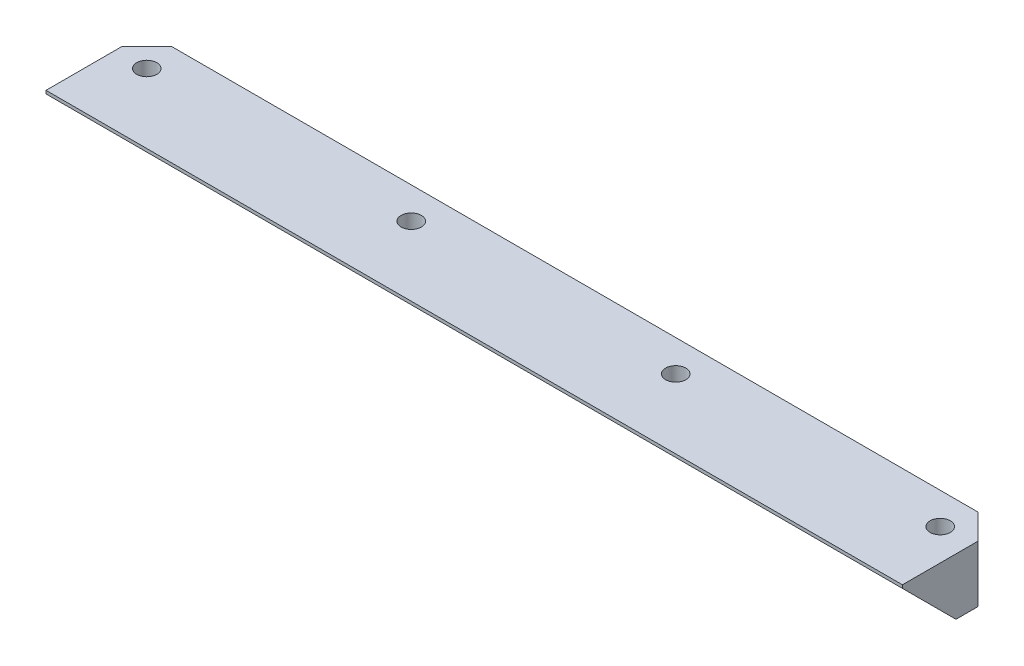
ISO-10303-21;
HEADER;
FILE_DESCRIPTION(('STEP AP214'),'2;1');
FILE_NAME('part.step','',(''),(''),'','','');
FILE_SCHEMA(('AUTOMOTIVE_DESIGN { 1 0 10303 214 1 1 1 1 }'));
ENDSEC;
DATA;
#1=APPLICATION_CONTEXT('core data for automotive mechanical design processes');
#2=APPLICATION_PROTOCOL_DEFINITION('international standard','automotive_design',2000,#1);
#3=PRODUCT_CONTEXT('',#1,'mechanical');
#4=PRODUCT('Part','Part','',(#3));
#5=PRODUCT_RELATED_PRODUCT_CATEGORY('part','',(#4));
#6=PRODUCT_DEFINITION_FORMATION('','',#4);
#7=PRODUCT_DEFINITION_CONTEXT('part definition',#1,'design');
#8=PRODUCT_DEFINITION('design','',#6,#7);
#9=PRODUCT_DEFINITION_SHAPE('','',#8);
#10=(LENGTH_UNIT() NAMED_UNIT(*) SI_UNIT(.MILLI.,.METRE.));
#11=(NAMED_UNIT(*) PLANE_ANGLE_UNIT() SI_UNIT($,.RADIAN.));
#12=(NAMED_UNIT(*) SI_UNIT($,.STERADIAN.) SOLID_ANGLE_UNIT());
#13=UNCERTAINTY_MEASURE_WITH_UNIT(LENGTH_MEASURE(1.E-05),#10,'distance_accuracy_value','');
#14=(GEOMETRIC_REPRESENTATION_CONTEXT(3) GLOBAL_UNCERTAINTY_ASSIGNED_CONTEXT((#13)) GLOBAL_UNIT_ASSIGNED_CONTEXT((#10,
#11,#12)) REPRESENTATION_CONTEXT('',''));
#15=CARTESIAN_POINT('',(0.,0.,0.));
#16=DIRECTION('',(0.,0.,1.));
#17=DIRECTION('',(1.,0.,0.));
#18=AXIS2_PLACEMENT_3D('',#15,#16,#17);
#19=CARTESIAN_POINT('',(107.95,14.2875,25.4));
#20=DIRECTION('',(0.,-1.,0.));
#21=DIRECTION('',(0.,0.,-1.));
#22=AXIS2_PLACEMENT_3D('',#19,#20,#21);
#23=PLANE('',#22);
#24=DIRECTION('',(-1.,0.,0.));
#25=VECTOR('',#24,1.);
#26=CARTESIAN_POINT('',(107.95,14.2875,0.));
#27=LINE('',#26,#25);
#28=CARTESIAN_POINT('',(101.6,14.2875,0.));
#29=VERTEX_POINT('',#28);
#30=CARTESIAN_POINT('',(-101.6,14.2875,0.));
#31=VERTEX_POINT('',#30);
#32=EDGE_CURVE('E114',#29,#31,#27,.T.);
#33=ORIENTED_EDGE('',*,*,#32,.T.);
#34=DIRECTION('',(-0.707106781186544,0.,0.707106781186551));
#35=VECTOR('',#34,1.);
#36=CARTESIAN_POINT('',(-101.6,14.2875,0.));
#37=LINE('',#36,#35);
#38=CARTESIAN_POINT('',(-107.95,14.2875,6.35000000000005));
#39=VERTEX_POINT('',#38);
#40=EDGE_CURVE('E149',#31,#39,#37,.T.);
#41=ORIENTED_EDGE('',*,*,#40,.T.);
#42=DIRECTION('',(0.,0.,1.));
#43=VECTOR('',#42,1.);
#44=CARTESIAN_POINT('',(-107.95,14.2875,25.4));
#45=LINE('',#44,#43);
#46=CARTESIAN_POINT('',(-107.95,14.2875,25.4));
#47=VERTEX_POINT('',#46);
#48=EDGE_CURVE('E111',#39,#47,#45,.T.);
#49=ORIENTED_EDGE('',*,*,#48,.T.);
#50=DIRECTION('',(-1.,0.,0.));
#51=VECTOR('',#50,1.);
#52=CARTESIAN_POINT('',(107.95,14.2875,25.4));
#53=LINE('',#52,#51);
#54=CARTESIAN_POINT('',(107.95,14.2875,25.4));
#55=VERTEX_POINT('',#54);
#56=EDGE_CURVE('E108',#55,#47,#53,.T.);
#57=ORIENTED_EDGE('',*,*,#56,.F.);
#58=DIRECTION('',(0.,0.,1.));
#59=VECTOR('',#58,1.);
#60=CARTESIAN_POINT('',(107.95,14.2875,25.4));
#61=LINE('',#60,#59);
#62=CARTESIAN_POINT('',(107.95,14.2875,6.35000000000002));
#63=VERTEX_POINT('',#62);
#64=EDGE_CURVE('E97',#63,#55,#61,.T.);
#65=ORIENTED_EDGE('',*,*,#64,.F.);
#66=DIRECTION('',(0.707106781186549,0.,0.707106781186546));
#67=VECTOR('',#66,1.);
#68=CARTESIAN_POINT('',(107.95,14.2875,6.35000000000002));
#69=LINE('',#68,#67);
#70=EDGE_CURVE('E147',#63,#29,#69,.F.);
#71=ORIENTED_EDGE('',*,*,#70,.T.);
#72=EDGE_LOOP('',(#33,#41,#49,#57,#65,#71));
#73=FACE_BOUND('',#72,.T.);
#74=CARTESIAN_POINT('',(100.0125,14.2875,7.93749999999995));
#75=DIRECTION('',(0.,1.,0.));
#76=DIRECTION('',(0.,0.,1.));
#77=AXIS2_PLACEMENT_3D('',#74,#75,#76);
#78=CIRCLE('',#77,2.55269999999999);
#79=CARTESIAN_POINT('',(100.0125,14.2875,10.4901999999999));
#80=VERTEX_POINT('',#79);
#81=EDGE_CURVE('E229',#80,#80,#78,.T.);
#82=ORIENTED_EDGE('',*,*,#81,.F.);
#83=EDGE_LOOP('',(#82));
#84=FACE_BOUND('',#83,.T.);
#85=CARTESIAN_POINT('',(33.3375,14.2875,7.93749999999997));
#86=DIRECTION('',(0.,1.,0.));
#87=DIRECTION('',(0.,0.,1.));
#88=AXIS2_PLACEMENT_3D('',#85,#86,#87);
#89=CIRCLE('',#88,2.55269999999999);
#90=CARTESIAN_POINT('',(33.3375,14.2875,10.4902));
#91=VERTEX_POINT('',#90);
#92=EDGE_CURVE('E223',#91,#91,#89,.T.);
#93=ORIENTED_EDGE('',*,*,#92,.F.);
#94=EDGE_LOOP('',(#93));
#95=FACE_BOUND('',#94,.T.);
#96=CARTESIAN_POINT('',(-33.3375,14.2875,7.93749999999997));
#97=DIRECTION('',(0.,1.,0.));
#98=DIRECTION('',(0.,0.,1.));
#99=AXIS2_PLACEMENT_3D('',#96,#97,#98);
#100=CIRCLE('',#99,2.55269999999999);
#101=CARTESIAN_POINT('',(-33.3375,14.2875,10.4902));
#102=VERTEX_POINT('',#101);
#103=EDGE_CURVE('E215',#102,#102,#100,.T.);
#104=ORIENTED_EDGE('',*,*,#103,.F.);
#105=EDGE_LOOP('',(#104));
#106=FACE_BOUND('',#105,.T.);
#107=CARTESIAN_POINT('',(-100.0125,14.2875,7.93749999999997));
#108=DIRECTION('',(0.,1.,0.));
#109=DIRECTION('',(0.,0.,1.));
#110=AXIS2_PLACEMENT_3D('',#107,#108,#109);
#111=CIRCLE('',#110,2.55269999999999);
#112=CARTESIAN_POINT('',(-100.0125,14.2875,10.4902));
#113=VERTEX_POINT('',#112);
#114=EDGE_CURVE('E212',#113,#113,#111,.T.);
#115=ORIENTED_EDGE('',*,*,#114,.F.);
#116=EDGE_LOOP('',(#115));
#117=FACE_BOUND('',#116,.T.);
#118=ADVANCED_FACE('F35',(#73,#84,#95,#106,#117),#23,.F.);
#119=CARTESIAN_POINT('',(107.95,14.2875,0.));
#120=DIRECTION('',(0.,0.,1.));
#121=DIRECTION('',(0.,-1.,0.));
#122=AXIS2_PLACEMENT_3D('',#119,#120,#121);
#123=PLANE('',#122);
#124=DIRECTION('',(-1.,0.,0.));
#125=VECTOR('',#124,1.);
#126=CARTESIAN_POINT('',(107.95,0.,0.));
#127=LINE('',#126,#125);
#128=CARTESIAN_POINT('',(101.6,0.,0.));
#129=VERTEX_POINT('',#128);
#130=CARTESIAN_POINT('',(-101.6,0.,0.));
#131=VERTEX_POINT('',#130);
#132=EDGE_CURVE('E127',#129,#131,#127,.T.);
#133=ORIENTED_EDGE('',*,*,#132,.T.);
#134=DIRECTION('',(0.,1.,0.));
#135=VECTOR('',#134,1.);
#136=CARTESIAN_POINT('',(-101.6,14.2875,0.));
#137=LINE('',#136,#135);
#138=EDGE_CURVE('E144',#131,#31,#137,.T.);
#139=ORIENTED_EDGE('',*,*,#138,.T.);
#140=ORIENTED_EDGE('',*,*,#32,.F.);
#141=DIRECTION('',(0.,-1.,0.));
#142=VECTOR('',#141,1.);
#143=CARTESIAN_POINT('',(101.6,14.2875,0.));
#144=LINE('',#143,#142);
#145=EDGE_CURVE('E142',#29,#129,#144,.T.);
#146=ORIENTED_EDGE('',*,*,#145,.T.);
#147=EDGE_LOOP('',(#133,#139,#140,#146));
#148=FACE_BOUND('',#147,.T.);
#149=ADVANCED_FACE('F157',(#148),#123,.F.);
#150=CARTESIAN_POINT('',(107.95,14.2875,25.4));
#151=DIRECTION('',(0.,0.,-1.));
#152=DIRECTION('',(-1.,0.,0.));
#153=AXIS2_PLACEMENT_3D('',#150,#151,#152);
#154=PLANE('',#153);
#155=DIRECTION('',(0.,-1.,0.));
#156=VECTOR('',#155,1.);
#157=CARTESIAN_POINT('',(-107.95,14.2875,25.4));
#158=LINE('',#157,#156);
#159=CARTESIAN_POINT('',(-107.95,13.49375,25.4));
#160=VERTEX_POINT('',#159);
#161=EDGE_CURVE('E129',#47,#160,#158,.T.);
#162=ORIENTED_EDGE('',*,*,#161,.T.);
#163=DIRECTION('',(-1.,0.,0.));
#164=VECTOR('',#163,1.);
#165=CARTESIAN_POINT('',(107.95,13.49375,25.4));
#166=LINE('',#165,#164);
#167=CARTESIAN_POINT('',(107.95,13.49375,25.4));
#168=VERTEX_POINT('',#167);
#169=EDGE_CURVE('E115',#168,#160,#166,.T.);
#170=ORIENTED_EDGE('',*,*,#169,.F.);
#171=DIRECTION('',(0.,-1.,0.));
#172=VECTOR('',#171,1.);
#173=CARTESIAN_POINT('',(107.95,14.2875,25.4));
#174=LINE('',#173,#172);
#175=EDGE_CURVE('E101',#55,#168,#174,.T.);
#176=ORIENTED_EDGE('',*,*,#175,.F.);
#177=ORIENTED_EDGE('',*,*,#56,.T.);
#178=EDGE_LOOP('',(#162,#170,#176,#177));
#179=FACE_BOUND('',#178,.T.);
#180=ADVANCED_FACE('F117',(#179),#154,.F.);
#181=CARTESIAN_POINT('',(107.95,0.,11.90625));
#182=DIRECTION('',(0.,0.707106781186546,-0.707106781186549));
#183=DIRECTION('',(0.,0.707106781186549,0.707106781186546));
#184=AXIS2_PLACEMENT_3D('',#181,#182,#183);
#185=PLANE('',#184);
#186=DIRECTION('',(0.,-0.707106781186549,-0.707106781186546));
#187=VECTOR('',#186,1.);
#188=CARTESIAN_POINT('',(-107.95,0.,11.90625));
#189=LINE('',#188,#187);
#190=CARTESIAN_POINT('',(-107.95,0.,11.90625));
#191=VERTEX_POINT('',#190);
#192=EDGE_CURVE('E132',#160,#191,#189,.T.);
#193=ORIENTED_EDGE('',*,*,#192,.T.);
#194=DIRECTION('',(-1.,0.,0.));
#195=VECTOR('',#194,1.);
#196=CARTESIAN_POINT('',(107.95,0.,11.90625));
#197=LINE('',#196,#195);
#198=CARTESIAN_POINT('',(107.95,0.,11.90625));
#199=VERTEX_POINT('',#198);
#200=EDGE_CURVE('E137',#199,#191,#197,.T.);
#201=ORIENTED_EDGE('',*,*,#200,.F.);
#202=DIRECTION('',(0.,-0.707106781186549,-0.707106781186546));
#203=VECTOR('',#202,1.);
#204=CARTESIAN_POINT('',(107.95,0.,11.90625));
#205=LINE('',#204,#203);
#206=EDGE_CURVE('E120',#168,#199,#205,.T.);
#207=ORIENTED_EDGE('',*,*,#206,.F.);
#208=ORIENTED_EDGE('',*,*,#169,.T.);
#209=EDGE_LOOP('',(#193,#201,#207,#208));
#210=FACE_BOUND('',#209,.T.);
#211=ADVANCED_FACE('F164',(#210),#185,.F.);
#212=CARTESIAN_POINT('',(107.95,0.,0.));
#213=DIRECTION('',(0.,1.,0.));
#214=DIRECTION('',(0.,0.,1.));
#215=AXIS2_PLACEMENT_3D('',#212,#213,#214);
#216=PLANE('',#215);
#217=CARTESIAN_POINT('',(-100.0125,0.,7.93749999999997));
#218=DIRECTION('',(0.,1.,0.));
#219=DIRECTION('',(0.,0.,1.));
#220=AXIS2_PLACEMENT_3D('',#217,#218,#219);
#221=CIRCLE('',#220,2.55269999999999);
#222=CARTESIAN_POINT('',(-100.0125,0.,10.4902));
#223=VERTEX_POINT('',#222);
#224=EDGE_CURVE('E209',#223,#223,#221,.T.);
#225=ORIENTED_EDGE('',*,*,#224,.T.);
#226=EDGE_LOOP('',(#225));
#227=FACE_BOUND('',#226,.T.);
#228=CARTESIAN_POINT('',(-33.3375,0.,7.93749999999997));
#229=DIRECTION('',(0.,1.,0.));
#230=DIRECTION('',(0.,0.,1.));
#231=AXIS2_PLACEMENT_3D('',#228,#229,#230);
#232=CIRCLE('',#231,2.5527);
#233=CARTESIAN_POINT('',(-33.3375,0.,10.4902));
#234=VERTEX_POINT('',#233);
#235=EDGE_CURVE('E220',#234,#234,#232,.T.);
#236=ORIENTED_EDGE('',*,*,#235,.T.);
#237=EDGE_LOOP('',(#236));
#238=FACE_BOUND('',#237,.T.);
#239=CARTESIAN_POINT('',(33.3375,0.,7.93749999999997));
#240=DIRECTION('',(0.,1.,0.));
#241=DIRECTION('',(0.,0.,1.));
#242=AXIS2_PLACEMENT_3D('',#239,#240,#241);
#243=CIRCLE('',#242,2.5527);
#244=CARTESIAN_POINT('',(33.3375,0.,10.4902));
#245=VERTEX_POINT('',#244);
#246=EDGE_CURVE('E226',#245,#245,#243,.T.);
#247=ORIENTED_EDGE('',*,*,#246,.T.);
#248=EDGE_LOOP('',(#247));
#249=FACE_BOUND('',#248,.T.);
#250=CARTESIAN_POINT('',(100.0125,0.,7.93749999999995));
#251=DIRECTION('',(0.,1.,0.));
#252=DIRECTION('',(0.,0.,1.));
#253=AXIS2_PLACEMENT_3D('',#250,#251,#252);
#254=CIRCLE('',#253,2.55269999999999);
#255=CARTESIAN_POINT('',(100.0125,0.,10.4901999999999));
#256=VERTEX_POINT('',#255);
#257=EDGE_CURVE('E130',#256,#256,#254,.T.);
#258=ORIENTED_EDGE('',*,*,#257,.T.);
#259=EDGE_LOOP('',(#258));
#260=FACE_BOUND('',#259,.T.);
#261=DIRECTION('',(0.,0.,-1.));
#262=VECTOR('',#261,1.);
#263=CARTESIAN_POINT('',(-107.95,0.,0.));
#264=LINE('',#263,#262);
#265=CARTESIAN_POINT('',(-107.95,0.,6.35000000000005));
#266=VERTEX_POINT('',#265);
#267=EDGE_CURVE('E105',#191,#266,#264,.T.);
#268=ORIENTED_EDGE('',*,*,#267,.T.);
#269=DIRECTION('',(0.707106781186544,0.,-0.707106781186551));
#270=VECTOR('',#269,1.);
#271=CARTESIAN_POINT('',(-101.6,0.,0.));
#272=LINE('',#271,#270);
#273=EDGE_CURVE('E43',#266,#131,#272,.T.);
#274=ORIENTED_EDGE('',*,*,#273,.T.);
#275=ORIENTED_EDGE('',*,*,#132,.F.);
#276=DIRECTION('',(-0.707106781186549,0.,-0.707106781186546));
#277=VECTOR('',#276,1.);
#278=CARTESIAN_POINT('',(107.95,0.,6.35000000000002));
#279=LINE('',#278,#277);
#280=CARTESIAN_POINT('',(107.95,0.,6.35000000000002));
#281=VERTEX_POINT('',#280);
#282=EDGE_CURVE('E50',#129,#281,#279,.F.);
#283=ORIENTED_EDGE('',*,*,#282,.T.);
#284=DIRECTION('',(0.,0.,-1.));
#285=VECTOR('',#284,1.);
#286=CARTESIAN_POINT('',(107.95,0.,0.));
#287=LINE('',#286,#285);
#288=EDGE_CURVE('E122',#199,#281,#287,.T.);
#289=ORIENTED_EDGE('',*,*,#288,.F.);
#290=ORIENTED_EDGE('',*,*,#200,.T.);
#291=EDGE_LOOP('',(#268,#274,#275,#283,#289,#290));
#292=FACE_BOUND('',#291,.T.);
#293=ADVANCED_FACE('F153',(#227,#238,#249,#260,#292),#216,.F.);
#294=CARTESIAN_POINT('',(107.95,0.,0.));
#295=DIRECTION('',(-1.,0.,0.));
#296=DIRECTION('',(0.,0.,1.));
#297=AXIS2_PLACEMENT_3D('',#294,#295,#296);
#298=PLANE('',#297);
#299=ORIENTED_EDGE('',*,*,#288,.T.);
#300=DIRECTION('',(0.,1.,0.));
#301=VECTOR('',#300,1.);
#302=CARTESIAN_POINT('',(107.95,0.,6.35000000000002));
#303=LINE('',#302,#301);
#304=EDGE_CURVE('E11',#281,#63,#303,.T.);
#305=ORIENTED_EDGE('',*,*,#304,.T.);
#306=ORIENTED_EDGE('',*,*,#64,.T.);
#307=ORIENTED_EDGE('',*,*,#175,.T.);
#308=ORIENTED_EDGE('',*,*,#206,.T.);
#309=EDGE_LOOP('',(#299,#305,#306,#307,#308));
#310=FACE_BOUND('',#309,.T.);
#311=ADVANCED_FACE('F99',(#310),#298,.F.);
#312=CARTESIAN_POINT('',(-107.95,0.,0.));
#313=DIRECTION('',(-1.,0.,0.));
#314=DIRECTION('',(0.,0.,1.));
#315=AXIS2_PLACEMENT_3D('',#312,#313,#314);
#316=PLANE('',#315);
#317=ORIENTED_EDGE('',*,*,#48,.F.);
#318=DIRECTION('',(0.,-1.,0.));
#319=VECTOR('',#318,1.);
#320=CARTESIAN_POINT('',(-107.95,0.,6.35000000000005));
#321=LINE('',#320,#319);
#322=EDGE_CURVE('E58',#39,#266,#321,.T.);
#323=ORIENTED_EDGE('',*,*,#322,.T.);
#324=ORIENTED_EDGE('',*,*,#267,.F.);
#325=ORIENTED_EDGE('',*,*,#192,.F.);
#326=ORIENTED_EDGE('',*,*,#161,.F.);
#327=EDGE_LOOP('',(#317,#323,#324,#325,#326));
#328=FACE_BOUND('',#327,.T.);
#329=ADVANCED_FACE('F161',(#328),#316,.T.);
#330=CARTESIAN_POINT('',(-101.6,14.2875,0.));
#331=DIRECTION('',(-0.707106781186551,0.,-0.707106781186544));
#332=DIRECTION('',(0.,-1.,0.));
#333=AXIS2_PLACEMENT_3D('',#330,#331,#332);
#334=PLANE('',#333);
#335=ORIENTED_EDGE('',*,*,#273,.F.);
#336=ORIENTED_EDGE('',*,*,#322,.F.);
#337=ORIENTED_EDGE('',*,*,#40,.F.);
#338=ORIENTED_EDGE('',*,*,#138,.F.);
#339=EDGE_LOOP('',(#335,#336,#337,#338));
#340=FACE_BOUND('',#339,.T.);
#341=ADVANCED_FACE('F160',(#340),#334,.T.);
#342=CARTESIAN_POINT('',(107.95,0.,6.35000000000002));
#343=DIRECTION('',(-0.707106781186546,0.,0.707106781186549));
#344=DIRECTION('',(0.,1.,0.));
#345=AXIS2_PLACEMENT_3D('',#342,#343,#344);
#346=PLANE('',#345);
#347=ORIENTED_EDGE('',*,*,#282,.F.);
#348=ORIENTED_EDGE('',*,*,#145,.F.);
#349=ORIENTED_EDGE('',*,*,#70,.F.);
#350=ORIENTED_EDGE('',*,*,#304,.F.);
#351=EDGE_LOOP('',(#347,#348,#349,#350));
#352=FACE_BOUND('',#351,.T.);
#353=ADVANCED_FACE('F37',(#352),#346,.F.);
#354=CARTESIAN_POINT('',(100.0125,14.2875,7.93749999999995));
#355=DIRECTION('',(0.,1.,0.));
#356=DIRECTION('',(0.,0.,1.));
#357=AXIS2_PLACEMENT_3D('',#354,#355,#356);
#358=CYLINDRICAL_SURFACE('',#357,2.55269999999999);
#359=ORIENTED_EDGE('',*,*,#257,.F.);
#360=EDGE_LOOP('',(#359));
#361=FACE_BOUND('',#360,.T.);
#362=ORIENTED_EDGE('',*,*,#81,.T.);
#363=EDGE_LOOP('',(#362));
#364=FACE_BOUND('',#363,.T.);
#365=ADVANCED_FACE('F168',(#361,#364),#358,.F.);
#366=CARTESIAN_POINT('',(33.3375,14.2875,7.93749999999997));
#367=DIRECTION('',(0.,1.,0.));
#368=DIRECTION('',(0.,0.,1.));
#369=AXIS2_PLACEMENT_3D('',#366,#367,#368);
#370=CYLINDRICAL_SURFACE('',#369,2.55269999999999);
#371=ORIENTED_EDGE('',*,*,#246,.F.);
#372=EDGE_LOOP('',(#371));
#373=FACE_BOUND('',#372,.T.);
#374=ORIENTED_EDGE('',*,*,#92,.T.);
#375=EDGE_LOOP('',(#374));
#376=FACE_BOUND('',#375,.T.);
#377=ADVANCED_FACE('F173',(#373,#376),#370,.F.);
#378=CARTESIAN_POINT('',(-33.3375,14.2875,7.93749999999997));
#379=DIRECTION('',(0.,1.,0.));
#380=DIRECTION('',(0.,0.,1.));
#381=AXIS2_PLACEMENT_3D('',#378,#379,#380);
#382=CYLINDRICAL_SURFACE('',#381,2.55269999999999);
#383=ORIENTED_EDGE('',*,*,#235,.F.);
#384=EDGE_LOOP('',(#383));
#385=FACE_BOUND('',#384,.T.);
#386=ORIENTED_EDGE('',*,*,#103,.T.);
#387=EDGE_LOOP('',(#386));
#388=FACE_BOUND('',#387,.T.);
#389=ADVANCED_FACE('F196',(#385,#388),#382,.F.);
#390=CARTESIAN_POINT('',(-100.0125,14.2875,7.93749999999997));
#391=DIRECTION('',(0.,1.,0.));
#392=DIRECTION('',(0.,0.,1.));
#393=AXIS2_PLACEMENT_3D('',#390,#391,#392);
#394=CYLINDRICAL_SURFACE('',#393,2.55269999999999);
#395=ORIENTED_EDGE('',*,*,#224,.F.);
#396=EDGE_LOOP('',(#395));
#397=FACE_BOUND('',#396,.T.);
#398=ORIENTED_EDGE('',*,*,#114,.T.);
#399=EDGE_LOOP('',(#398));
#400=FACE_BOUND('',#399,.T.);
#401=ADVANCED_FACE('F200',(#397,#400),#394,.F.);
#402=CLOSED_SHELL('',(#118,#149,#180,#211,#293,#311,#329,#341,#353,#365,#377,#389,#401));
#403=MANIFOLD_SOLID_BREP('B2',#402);
#404=ADVANCED_BREP_SHAPE_REPRESENTATION('',(#18,#403),#14);
#405=SHAPE_DEFINITION_REPRESENTATION(#9,#404);
ENDSEC;
END-ISO-10303-21;
